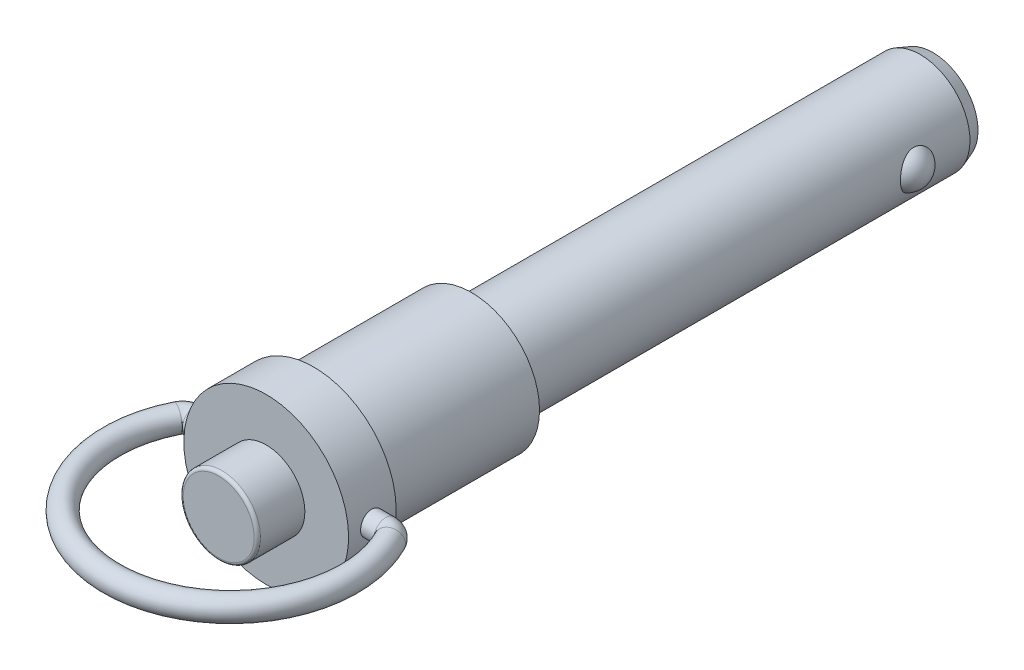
ISO-10303-21;
HEADER;
FILE_DESCRIPTION(('STEP AP214'),'2;1');
FILE_NAME('part.step','',(''),(''),'','','');
FILE_SCHEMA(('AUTOMOTIVE_DESIGN { 1 0 10303 214 1 1 1 1 }'));
ENDSEC;
DATA;
#1=APPLICATION_CONTEXT('core data for automotive mechanical design processes');
#2=APPLICATION_PROTOCOL_DEFINITION('international standard','automotive_design',2000,#1);
#3=PRODUCT_CONTEXT('',#1,'mechanical');
#4=PRODUCT('Part','Part','',(#3));
#5=PRODUCT_RELATED_PRODUCT_CATEGORY('part','',(#4));
#6=PRODUCT_DEFINITION_FORMATION('','',#4);
#7=PRODUCT_DEFINITION_CONTEXT('part definition',#1,'design');
#8=PRODUCT_DEFINITION('design','',#6,#7);
#9=PRODUCT_DEFINITION_SHAPE('','',#8);
#10=(LENGTH_UNIT() NAMED_UNIT(*) SI_UNIT(.MILLI.,.METRE.));
#11=(NAMED_UNIT(*) PLANE_ANGLE_UNIT() SI_UNIT($,.RADIAN.));
#12=(NAMED_UNIT(*) SI_UNIT($,.STERADIAN.) SOLID_ANGLE_UNIT());
#13=UNCERTAINTY_MEASURE_WITH_UNIT(LENGTH_MEASURE(1.E-05),#10,'distance_accuracy_value','');
#14=(GEOMETRIC_REPRESENTATION_CONTEXT(3) GLOBAL_UNCERTAINTY_ASSIGNED_CONTEXT((#13)) GLOBAL_UNIT_ASSIGNED_CONTEXT((#10,
#11,#12)) REPRESENTATION_CONTEXT('',''));
#15=CARTESIAN_POINT('',(0.,0.,0.));
#16=DIRECTION('',(0.,0.,1.));
#17=DIRECTION('',(1.,0.,0.));
#18=AXIS2_PLACEMENT_3D('',#15,#16,#17);
#19=CARTESIAN_POINT('',(-7.23283748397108,0.,-73.9826));
#20=DIRECTION('',(0.,0.,1.));
#21=DIRECTION('',(0.,1.,0.));
#22=AXIS2_PLACEMENT_3D('',#19,#20,#21);
#23=PLANE('',#22);
#24=CARTESIAN_POINT('',(0.,0.,-73.9826));
#25=DIRECTION('',(0.,0.,1.));
#26=DIRECTION('',(0.,1.,0.));
#27=AXIS2_PLACEMENT_3D('',#24,#25,#26);
#28=CIRCLE('',#27,7.23283748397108);
#29=CARTESIAN_POINT('',(0.,7.23283748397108,-73.9826));
#30=VERTEX_POINT('',#29);
#31=EDGE_CURVE('E210',#30,#30,#28,.T.);
#32=ORIENTED_EDGE('',*,*,#31,.F.);
#33=EDGE_LOOP('',(#32));
#34=FACE_BOUND('',#33,.T.);
#35=ADVANCED_FACE('F14',(#34),#23,.F.);
#36=CARTESIAN_POINT('',(6.3254,0.,-63.5178));
#37=DIRECTION('',(0.,0.,1.));
#38=DIRECTION('',(-1.,0.,0.));
#39=AXIS2_PLACEMENT_3D('',#36,#37,#38);
#40=SPHERICAL_SURFACE('',#39,3.175);
#41=CARTESIAN_POINT('',(7.972425,0.,-60.8034062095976));
#42=CARTESIAN_POINT('',(7.97241726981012,0.174963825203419,-60.8034110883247));
#43=CARTESIAN_POINT('',(7.96661031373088,0.350072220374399,-60.8168531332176));
#44=CARTESIAN_POINT('',(7.94391651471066,0.695574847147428,-60.8705412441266));
#45=CARTESIAN_POINT('',(7.92701418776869,0.865962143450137,-60.9108247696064));
#46=CARTESIAN_POINT('',(7.88381094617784,1.19705751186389,-61.0178494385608));
#47=CARTESIAN_POINT('',(7.85750751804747,1.35776298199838,-61.084597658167));
#48=CARTESIAN_POINT('',(7.79828591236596,1.66454963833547,-61.2437588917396));
#49=CARTESIAN_POINT('',(7.76536929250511,1.81063425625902,-61.336165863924));
#50=CARTESIAN_POINT('',(7.6973220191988,2.08082133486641,-61.5434318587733));
#51=CARTESIAN_POINT('',(7.6622476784,2.20529978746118,-61.6578132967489));
#52=CARTESIAN_POINT('',(7.61082801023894,2.374525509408,-61.8452714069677));
#53=CARTESIAN_POINT('',(7.59387880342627,2.42804053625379,-61.9104406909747));
#54=CARTESIAN_POINT('',(7.56094914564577,2.52871559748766,-62.045725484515));
#55=CARTESIAN_POINT('',(7.54496815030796,2.57587922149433,-62.115838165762));
#56=CARTESIAN_POINT('',(7.51569590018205,2.66002101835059,-62.2550958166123));
#57=CARTESIAN_POINT('',(7.50229271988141,2.69749875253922,-62.3239160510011));
#58=CARTESIAN_POINT('',(7.47725403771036,2.76614659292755,-62.4649044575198));
#59=CARTESIAN_POINT('',(7.46561758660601,2.79732008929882,-62.5370708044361));
#60=CARTESIAN_POINT('',(7.44451748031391,2.85299970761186,-62.6841997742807));
#61=CARTESIAN_POINT('',(7.43505273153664,2.87750918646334,-62.7591609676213));
#62=CARTESIAN_POINT('',(7.41863811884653,2.919568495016,-62.9112788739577));
#63=CARTESIAN_POINT('',(7.41168797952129,2.93711908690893,-62.9884353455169));
#64=CARTESIAN_POINT('',(7.40116212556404,2.96353478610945,-63.1359046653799));
#65=CARTESIAN_POINT('',(7.39730521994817,2.97312751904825,-63.2060679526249));
#66=CARTESIAN_POINT('',(7.39192783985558,2.98647205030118,-63.3470623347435));
#67=CARTESIAN_POINT('',(7.3904081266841,2.99022194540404,-63.4178936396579));
#68=CARTESIAN_POINT('',(7.38975833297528,2.99182794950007,-63.5595897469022));
#69=CARTESIAN_POINT('',(7.39062662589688,2.98968807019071,-63.6304544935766));
#70=CARTESIAN_POINT('',(7.39471686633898,2.97955470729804,-63.7717034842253));
#71=CARTESIAN_POINT('',(7.39793967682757,2.97155907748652,-63.8420875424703));
#72=CARTESIAN_POINT('',(7.41052697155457,2.94009947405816,-64.0439191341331));
#73=CARTESIAN_POINT('',(7.42280379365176,2.90920494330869,-64.1741115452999));
#74=CARTESIAN_POINT('',(7.45413145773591,2.82795803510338,-64.4273054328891));
#75=CARTESIAN_POINT('',(7.47318306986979,2.77760344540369,-64.5503060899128));
#76=CARTESIAN_POINT('',(7.51696016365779,2.65690222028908,-64.7909708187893));
#77=CARTESIAN_POINT('',(7.5418730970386,2.58587106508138,-64.9082567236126));
#78=CARTESIAN_POINT('',(7.59450635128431,2.426938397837,-65.1300314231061));
#79=CARTESIAN_POINT('',(7.62222751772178,2.33903179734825,-65.234516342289));
#80=CARTESIAN_POINT('',(7.68069620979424,2.13967899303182,-65.4383986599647));
#81=CARTESIAN_POINT('',(7.71148158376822,2.02679150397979,-65.5363756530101));
#82=CARTESIAN_POINT('',(7.77061509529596,1.78672707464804,-65.7138815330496));
#83=CARTESIAN_POINT('',(7.79896157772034,1.65954056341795,-65.7933979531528));
#84=CARTESIAN_POINT('',(7.85313577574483,1.38188004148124,-65.9395063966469));
#85=CARTESIAN_POINT('',(7.87849512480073,1.23034006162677,-66.0042480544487));
#86=CARTESIAN_POINT('',(7.92093083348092,0.918236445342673,-66.1099613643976));
#87=CARTESIAN_POINT('',(7.9380155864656,0.757682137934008,-66.1509571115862));
#88=CARTESIAN_POINT('',(7.95754077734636,0.496793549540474,-66.1973352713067));
#89=CARTESIAN_POINT('',(7.96310427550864,0.397984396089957,-66.2104005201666));
#90=CARTESIAN_POINT('',(7.97054862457,0.199465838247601,-66.2278312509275));
#91=CARTESIAN_POINT('',(7.97242940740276,0.0997564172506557,-66.2321965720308));
#92=CARTESIAN_POINT('',(7.97241726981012,-0.174963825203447,-66.2321889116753));
#93=CARTESIAN_POINT('',(7.96661031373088,-0.350072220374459,-66.2187468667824));
#94=CARTESIAN_POINT('',(7.94391651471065,-0.695574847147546,-66.1650587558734));
#95=CARTESIAN_POINT('',(7.92701418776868,-0.86596214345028,-66.1247752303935));
#96=CARTESIAN_POINT('',(7.88381094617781,-1.19705751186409,-66.0177505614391));
#97=CARTESIAN_POINT('',(7.85750751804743,-1.3577629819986,-65.9510023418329));
#98=CARTESIAN_POINT('',(7.7982859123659,-1.66454963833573,-65.7918411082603));
#99=CARTESIAN_POINT('',(7.76536929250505,-1.8106342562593,-65.6994341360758));
#100=CARTESIAN_POINT('',(7.69732201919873,-2.08082133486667,-65.4921681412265));
#101=CARTESIAN_POINT('',(7.66224767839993,-2.20529978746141,-65.3777867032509));
#102=CARTESIAN_POINT('',(7.61082801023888,-2.37452550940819,-65.190328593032));
#103=CARTESIAN_POINT('',(7.59387880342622,-2.42804053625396,-65.125159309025));
#104=CARTESIAN_POINT('',(7.56094914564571,-2.52871559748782,-64.9898745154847));
#105=CARTESIAN_POINT('',(7.54496815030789,-2.57587922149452,-64.9197618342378));
#106=CARTESIAN_POINT('',(7.51569590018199,-2.66002101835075,-64.7805041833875));
#107=CARTESIAN_POINT('',(7.50229271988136,-2.69749875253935,-64.7116839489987));
#108=CARTESIAN_POINT('',(7.47725403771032,-2.76614659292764,-64.57069554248));
#109=CARTESIAN_POINT('',(7.46561758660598,-2.79732008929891,-64.4985291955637));
#110=CARTESIAN_POINT('',(7.44451748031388,-2.85299970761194,-64.351400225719));
#111=CARTESIAN_POINT('',(7.43505273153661,-2.87750918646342,-64.2764390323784));
#112=CARTESIAN_POINT('',(7.41863811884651,-2.91956849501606,-64.124321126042));
#113=CARTESIAN_POINT('',(7.41168797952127,-2.93711908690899,-64.0471646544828));
#114=CARTESIAN_POINT('',(7.40116212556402,-2.96353478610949,-63.8996953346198));
#115=CARTESIAN_POINT('',(7.39730521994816,-2.97312751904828,-63.8295320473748));
#116=CARTESIAN_POINT('',(7.39192783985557,-2.98647205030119,-63.6885376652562));
#117=CARTESIAN_POINT('',(7.3904081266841,-2.99022194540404,-63.6177063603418));
#118=CARTESIAN_POINT('',(7.38975833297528,-2.99182794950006,-63.4760102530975));
#119=CARTESIAN_POINT('',(7.39062662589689,-2.98968807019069,-63.4051455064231));
#120=CARTESIAN_POINT('',(7.39471686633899,-2.979554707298,-63.2638965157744));
#121=CARTESIAN_POINT('',(7.39793967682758,-2.97155907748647,-63.1935124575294));
#122=CARTESIAN_POINT('',(7.41052697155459,-2.94009947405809,-62.9916808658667));
#123=CARTESIAN_POINT('',(7.42280379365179,-2.90920494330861,-62.8614884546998));
#124=CARTESIAN_POINT('',(7.45413145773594,-2.82795803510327,-62.6082945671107));
#125=CARTESIAN_POINT('',(7.47318306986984,-2.77760344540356,-62.4852939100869));
#126=CARTESIAN_POINT('',(7.51696016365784,-2.65690222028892,-62.2446291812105));
#127=CARTESIAN_POINT('',(7.54187309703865,-2.58587106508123,-62.1273432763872));
#128=CARTESIAN_POINT('',(7.59450635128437,-2.42693839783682,-61.9055685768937));
#129=CARTESIAN_POINT('',(7.62222751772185,-2.33903179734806,-61.8010836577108));
#130=CARTESIAN_POINT('',(7.68069620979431,-2.13967899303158,-61.5972013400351));
#131=CARTESIAN_POINT('',(7.71148158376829,-2.02679150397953,-61.4992243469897));
#132=CARTESIAN_POINT('',(7.77061509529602,-1.78672707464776,-61.3217184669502));
#133=CARTESIAN_POINT('',(7.7989615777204,-1.65954056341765,-61.242202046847));
#134=CARTESIAN_POINT('',(7.85313577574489,-1.38188004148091,-61.0960936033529));
#135=CARTESIAN_POINT('',(7.87849512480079,-1.23034006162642,-61.0313519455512));
#136=CARTESIAN_POINT('',(7.92093083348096,-0.918236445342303,-60.9256386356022));
#137=CARTESIAN_POINT('',(7.93801558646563,-0.757682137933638,-60.8846428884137));
#138=CARTESIAN_POINT('',(7.95754077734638,-0.496793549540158,-60.8382647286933));
#139=CARTESIAN_POINT('',(7.96310427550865,-0.397984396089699,-60.8251994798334));
#140=CARTESIAN_POINT('',(7.97054862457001,-0.199465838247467,-60.8077687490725));
#141=CARTESIAN_POINT('',(7.97242940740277,-0.0997564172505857,-60.8034034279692));
#142=CARTESIAN_POINT('',(7.972425,0.,-60.8034062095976));
#143=B_SPLINE_CURVE_WITH_KNOTS('',3,(#41,#42,#43,#44,#45,#46,#47,#48,#49,#50,#51,#52,#53,#54,
#55,#56,#57,#58,#59,#60,#61,#62,#63,#64,#65,#66,#67,#68,#69,#70,#71,#72,#73,#74,#75,#76,#77,#78,
#79,#80,#81,#82,#83,#84,#85,#86,#87,#88,#89,#90,#91,#92,#93,#94,#95,#96,#97,#98,#99,#100,#101,
#102,#103,#104,#105,#106,#107,#108,#109,#110,#111,#112,#113,#114,#115,#116,#117,#118,#119,#120,
#121,#122,#123,#124,#125,#126,#127,#128,#129,#130,#131,#132,#133,#134,#135,#136,#137,#138,#139,
#140,#141,#142),.UNSPECIFIED.,.T.,.F.,(4,2,2,2,2,2,2,2,2,2,2,2,2,2,2,2,2,2,2,2,2,2,2,2,2,2,2,2,
2,2,2,2,2,2,2,2,2,2,2,2,2,2,2,2,2,2,2,2,2,2,4),(0.,0.524532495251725,1.04979855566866,
1.57520515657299,2.10048814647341,2.61543479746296,2.87315909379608,3.13073711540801,
3.36891793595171,3.60697032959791,3.8449025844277,4.08280877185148,4.29529683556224,
4.50785409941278,4.72026662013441,4.93275703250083,5.33386765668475,5.73502389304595,
6.15136290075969,6.56782764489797,7.02375816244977,7.47999569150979,7.97801301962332,
8.47552411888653,8.77458316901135,9.07364774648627,9.5981802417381,10.1234463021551,
10.6488529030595,11.17413589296,11.6890825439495,11.9468068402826,12.2043848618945,
12.4425656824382,12.6806180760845,12.9185503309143,13.1564565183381,13.3689445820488,
13.5815018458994,13.793914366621,14.0064047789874,14.4075154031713,14.8086716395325,
15.2250106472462,15.6414753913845,16.0974059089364,16.5536434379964,17.05166076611,
17.5491718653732,17.8482309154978,18.1472954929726),.UNSPECIFIED.);
#144=CARTESIAN_POINT('',(7.972425,0.,-60.8034062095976));
#145=VERTEX_POINT('',#144);
#146=EDGE_CURVE('E170',#145,#145,#143,.T.);
#147=ORIENTED_EDGE('',*,*,#146,.F.);
#148=EDGE_LOOP('',(#147));
#149=FACE_BOUND('',#148,.T.);
#150=ADVANCED_FACE('F143',(#149),#40,.T.);
#151=CARTESIAN_POINT('',(-6.3246,0.,-63.5178));
#152=DIRECTION('',(0.,0.,1.));
#153=DIRECTION('',(-1.,0.,0.));
#154=AXIS2_PLACEMENT_3D('',#151,#152,#153);
#155=SPHERICAL_SURFACE('',#154,3.175);
#156=CARTESIAN_POINT('',(-7.972425,0.,-66.2317082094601));
#157=CARTESIAN_POINT('',(-7.97241727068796,0.174952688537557,-66.2317033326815));
#158=CARTESIAN_POINT('',(-7.96661105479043,0.350049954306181,-66.2182623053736));
#159=CARTESIAN_POINT('',(-7.94392013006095,0.695530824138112,-66.1645780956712));
#160=CARTESIAN_POINT('',(-7.92701993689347,0.865907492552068,-66.1242974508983));
#161=CARTESIAN_POINT('',(-7.88382210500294,1.19698257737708,-66.0172798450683));
#162=CARTESIAN_POINT('',(-7.85752194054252,1.35767837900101,-65.950535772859));
#163=CARTESIAN_POINT('',(-7.79830777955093,1.66444625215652,-65.7913834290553));
#164=CARTESIAN_POINT('',(-7.76539534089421,1.81052175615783,-65.6989812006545));
#165=CARTESIAN_POINT('',(-7.69735815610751,2.08068673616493,-65.4917274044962));
#166=CARTESIAN_POINT('',(-7.66228978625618,2.20515274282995,-65.3773541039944));
#167=CARTESIAN_POINT('',(-7.61087967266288,2.37435974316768,-65.1899087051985));
#168=CARTESIAN_POINT('',(-7.593933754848,2.42786851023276,-65.124743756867));
#169=CARTESIAN_POINT('',(-7.56101087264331,2.52853087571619,-64.9894677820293));
#170=CARTESIAN_POINT('',(-7.54503336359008,2.57568806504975,-64.9193595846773));
#171=CARTESIAN_POINT('',(-7.515769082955,2.65981407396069,-64.7801158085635));
#172=CARTESIAN_POINT('',(-7.5023702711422,2.69728292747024,-64.7113052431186));
#173=CARTESIAN_POINT('',(-7.47734019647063,2.7659135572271,-64.5703368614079));
#174=CARTESIAN_POINT('',(-7.46570798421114,2.79707872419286,-64.4981808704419));
#175=CARTESIAN_POINT('',(-7.44461613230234,2.8527421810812,-64.3510733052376));
#176=CARTESIAN_POINT('',(-7.43515539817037,2.87724383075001,-64.2761231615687));
#177=CARTESIAN_POINT('',(-7.41874848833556,2.91928796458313,-64.1240280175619));
#178=CARTESIAN_POINT('',(-7.41180203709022,2.93683121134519,-64.0468832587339));
#179=CARTESIAN_POINT('',(-7.40128307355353,2.96323267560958,-63.8994411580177));
#180=CARTESIAN_POINT('',(-7.39742927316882,2.97281883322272,-63.829293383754));
#181=CARTESIAN_POINT('',(-7.3920573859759,2.98615137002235,-63.6883306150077));
#182=CARTESIAN_POINT('',(-7.39054006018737,2.98989584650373,-63.6175154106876));
#183=CARTESIAN_POINT('',(-7.38989424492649,2.99149222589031,-63.4758519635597));
#184=CARTESIAN_POINT('',(-7.39076412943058,2.98934813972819,-63.4050037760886));
#185=CARTESIAN_POINT('',(-7.39485671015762,2.97920762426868,-63.2637882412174));
#186=CARTESIAN_POINT('',(-7.39808026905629,2.971209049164,-63.1934210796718));
#187=CARTESIAN_POINT('',(-7.41066840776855,2.93974298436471,-62.9916394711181));
#188=CARTESIAN_POINT('',(-7.42294415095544,2.90884676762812,-62.8614803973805));
#189=CARTESIAN_POINT('',(-7.45426659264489,2.82760178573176,-62.6083526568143));
#190=CARTESIAN_POINT('',(-7.4733140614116,2.77725080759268,-62.4853848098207));
#191=CARTESIAN_POINT('',(-7.51708080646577,2.6565607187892,-62.2447817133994));
#192=CARTESIAN_POINT('',(-7.5419875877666,2.5855367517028,-62.1275248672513));
#193=CARTESIAN_POINT('',(-7.59460690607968,2.42662332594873,-61.9058059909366));
#194=CARTESIAN_POINT('',(-7.62232028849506,2.33872877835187,-61.80134783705));
#195=CARTESIAN_POINT('',(-7.68077324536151,2.13940178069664,-61.5975136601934));
#196=CARTESIAN_POINT('',(-7.71155061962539,2.02652778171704,-61.4995584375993));
#197=CARTESIAN_POINT('',(-7.77066832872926,1.78649437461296,-61.3220926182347));
#198=CARTESIAN_POINT('',(-7.79900700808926,1.65932539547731,-61.2425944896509));
#199=CARTESIAN_POINT('',(-7.85316757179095,1.38169777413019,-61.0965158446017));
#200=CARTESIAN_POINT('',(-7.87852090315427,1.23017281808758,-61.0317864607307));
#201=CARTESIAN_POINT('',(-7.92094613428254,0.918101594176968,-60.9260941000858));
#202=CARTESIAN_POINT('',(-7.93802642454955,0.757564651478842,-60.8851070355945));
#203=CARTESIAN_POINT('',(-7.95754577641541,0.496710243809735,-60.8387404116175));
#204=CARTESIAN_POINT('',(-7.96310740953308,0.397917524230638,-60.8256788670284));
#205=CARTESIAN_POINT('',(-7.97054925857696,0.199432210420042,-60.8082530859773));
#206=CARTESIAN_POINT('',(-7.97242940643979,0.0997395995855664,-60.8038890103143));
#207=CARTESIAN_POINT('',(-7.97241727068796,-0.174952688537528,-60.8038966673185));
#208=CARTESIAN_POINT('',(-7.96661105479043,-0.350049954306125,-60.8173376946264));
#209=CARTESIAN_POINT('',(-7.94392013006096,-0.695530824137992,-60.8710219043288));
#210=CARTESIAN_POINT('',(-7.92701993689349,-0.86590749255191,-60.9113025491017));
#211=CARTESIAN_POINT('',(-7.88382210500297,-1.19698257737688,-61.0183201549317));
#212=CARTESIAN_POINT('',(-7.85752194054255,-1.3576783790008,-61.0850642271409));
#213=CARTESIAN_POINT('',(-7.79830777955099,-1.66444625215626,-61.2442165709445));
#214=CARTESIAN_POINT('',(-7.76539534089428,-1.81052175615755,-61.3366187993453));
#215=CARTESIAN_POINT('',(-7.69735815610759,-2.08068673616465,-61.5438725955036));
#216=CARTESIAN_POINT('',(-7.66228978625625,-2.2051527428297,-61.6582458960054));
#217=CARTESIAN_POINT('',(-7.61087967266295,-2.37435974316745,-61.8456912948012));
#218=CARTESIAN_POINT('',(-7.59393375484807,-2.42786851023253,-61.9108562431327));
#219=CARTESIAN_POINT('',(-7.56101087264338,-2.52853087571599,-62.0461322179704));
#220=CARTESIAN_POINT('',(-7.54503336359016,-2.57568806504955,-62.1162404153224));
#221=CARTESIAN_POINT('',(-7.51576908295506,-2.65981407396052,-62.2554841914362));
#222=CARTESIAN_POINT('',(-7.50237027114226,-2.69728292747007,-62.3242947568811));
#223=CARTESIAN_POINT('',(-7.47734019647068,-2.76591355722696,-62.4652631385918));
#224=CARTESIAN_POINT('',(-7.46570798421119,-2.79707872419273,-62.5374191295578));
#225=CARTESIAN_POINT('',(-7.44461613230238,-2.8527421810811,-62.6845266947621));
#226=CARTESIAN_POINT('',(-7.4351553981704,-2.87724383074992,-62.759476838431));
#227=CARTESIAN_POINT('',(-7.41874848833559,-2.91928796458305,-62.9115719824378));
#228=CARTESIAN_POINT('',(-7.41180203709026,-2.93683121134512,-62.9887167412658));
#229=CARTESIAN_POINT('',(-7.40128307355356,-2.96323267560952,-63.136158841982));
#230=CARTESIAN_POINT('',(-7.39742927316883,-2.97281883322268,-63.2063066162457));
#231=CARTESIAN_POINT('',(-7.3920573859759,-2.98615137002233,-63.3472693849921));
#232=CARTESIAN_POINT('',(-7.39054006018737,-2.98989584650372,-63.4180845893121));
#233=CARTESIAN_POINT('',(-7.38989424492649,-2.99149222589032,-63.55974803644));
#234=CARTESIAN_POINT('',(-7.39076412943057,-2.9893481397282,-63.6305962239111));
#235=CARTESIAN_POINT('',(-7.3948567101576,-2.97920762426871,-63.7718117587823));
#236=CARTESIAN_POINT('',(-7.39808026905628,-2.97120904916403,-63.8421789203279));
#237=CARTESIAN_POINT('',(-7.41066840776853,-2.93974298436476,-64.0439605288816));
#238=CARTESIAN_POINT('',(-7.42294415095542,-2.90884676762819,-64.1741196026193));
#239=CARTESIAN_POINT('',(-7.45426659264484,-2.82760178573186,-64.4272473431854));
#240=CARTESIAN_POINT('',(-7.47331406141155,-2.77725080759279,-64.550215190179));
#241=CARTESIAN_POINT('',(-7.51708080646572,-2.65656071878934,-64.7908182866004));
#242=CARTESIAN_POINT('',(-7.54198758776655,-2.58553675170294,-64.9080751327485));
#243=CARTESIAN_POINT('',(-7.59460690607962,-2.4266233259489,-65.1297940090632));
#244=CARTESIAN_POINT('',(-7.62232028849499,-2.33872877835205,-65.2342521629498));
#245=CARTESIAN_POINT('',(-7.68077324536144,-2.13940178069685,-65.4380863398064));
#246=CARTESIAN_POINT('',(-7.71155061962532,-2.02652778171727,-65.5360415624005));
#247=CARTESIAN_POINT('',(-7.7706683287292,-1.78649437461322,-65.7135073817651));
#248=CARTESIAN_POINT('',(-7.7990070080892,-1.65932539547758,-65.7930055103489));
#249=CARTESIAN_POINT('',(-7.8531675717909,-1.38169777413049,-65.9390841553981));
#250=CARTESIAN_POINT('',(-7.87852090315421,-1.23017281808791,-66.0038135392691));
#251=CARTESIAN_POINT('',(-7.9209461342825,-0.918101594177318,-66.1095058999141));
#252=CARTESIAN_POINT('',(-7.93802642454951,-0.75756465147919,-66.1504929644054));
#253=CARTESIAN_POINT('',(-7.95754577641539,-0.496710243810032,-66.1968595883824));
#254=CARTESIAN_POINT('',(-7.96310740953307,-0.397917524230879,-66.2099211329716));
#255=CARTESIAN_POINT('',(-7.97054925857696,-0.199432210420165,-66.2273469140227));
#256=CARTESIAN_POINT('',(-7.97242940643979,-0.0997395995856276,-66.2317109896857));
#257=CARTESIAN_POINT('',(-7.972425,0.,-66.2317082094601));
#258=B_SPLINE_CURVE_WITH_KNOTS('',3,(#156,#157,#158,#159,#160,#161,#162,#163,#164,#165,#166,
#167,#168,#169,#170,#171,#172,#173,#174,#175,#176,#177,#178,#179,#180,#181,#182,#183,#184,#185,
#186,#187,#188,#189,#190,#191,#192,#193,#194,#195,#196,#197,#198,#199,#200,#201,#202,#203,#204,
#205,#206,#207,#208,#209,#210,#211,#212,#213,#214,#215,#216,#217,#218,#219,#220,#221,#222,#223,
#224,#225,#226,#227,#228,#229,#230,#231,#232,#233,#234,#235,#236,#237,#238,#239,#240,#241,#242,
#243,#244,#245,#246,#247,#248,#249,#250,#251,#252,#253,#254,#255,#256,#257),.UNSPECIFIED.,.T.,
.F.,(4,2,2,2,2,2,2,2,2,2,2,2,2,2,2,2,2,2,2,2,2,2,2,2,2,2,2,2,2,2,2,2,2,2,2,2,2,2,2,2,2,2,2,2,2,
2,2,2,2,2,4),(0.,0.524499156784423,1.04973194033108,1.57510595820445,2.10035634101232,
2.61525617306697,2.87295695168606,3.130511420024,3.36865238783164,3.6066649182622,
3.84455721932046,4.08242344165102,4.29486234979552,4.50737043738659,4.71973381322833,
4.93217506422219,5.33319020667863,5.7342509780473,6.15050279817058,6.56688037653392,
7.02273464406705,7.47889596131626,7.97685568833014,8.47430932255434,8.77331798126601,
9.07233216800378,9.59683132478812,10.1220641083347,10.647438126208,11.1726885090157,
11.6875883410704,11.9452891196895,12.2028435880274,12.4409845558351,12.6789970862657,
12.9168893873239,13.1547556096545,13.367194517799,13.5797026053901,13.7920659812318,
14.0045072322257,14.4055223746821,14.8065831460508,15.2228349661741,15.6392125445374,
16.0950668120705,16.5512281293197,17.0491878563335,17.5466414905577,17.8456501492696,
18.1446643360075),.UNSPECIFIED.);
#259=CARTESIAN_POINT('',(-7.972425,0.,-66.2317082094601));
#260=VERTEX_POINT('',#259);
#261=EDGE_CURVE('E25',#260,#260,#258,.T.);
#262=ORIENTED_EDGE('',*,*,#261,.F.);
#263=EDGE_LOOP('',(#262));
#264=FACE_BOUND('',#263,.T.);
#265=ADVANCED_FACE('F149',(#264),#155,.T.);
#266=CARTESIAN_POINT('',(0.,0.,-71.9506));
#267=DIRECTION('',(0.,0.,1.));
#268=DIRECTION('',(0.,1.,0.));
#269=AXIS2_PLACEMENT_3D('',#266,#267,#268);
#270=CONICAL_SURFACE('',#269,7.972425,0.349065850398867);
#271=CARTESIAN_POINT('',(0.,0.,-71.9506));
#272=DIRECTION('',(0.,0.,1.));
#273=DIRECTION('',(0.,1.,0.));
#274=AXIS2_PLACEMENT_3D('',#271,#272,#273);
#275=CIRCLE('',#274,7.972425);
#276=CARTESIAN_POINT('',(0.,7.972425,-71.9506));
#277=VERTEX_POINT('',#276);
#278=EDGE_CURVE('E9',#277,#277,#275,.T.);
#279=ORIENTED_EDGE('',*,*,#278,.F.);
#280=EDGE_LOOP('',(#279));
#281=FACE_BOUND('',#280,.T.);
#282=ORIENTED_EDGE('',*,*,#31,.T.);
#283=EDGE_LOOP('',(#282));
#284=FACE_BOUND('',#283,.T.);
#285=ADVANCED_FACE('F177',(#281,#284),#270,.T.);
#286=CARTESIAN_POINT('',(0.,0.,-10.));
#287=DIRECTION('',(0.,0.,1.));
#288=DIRECTION('',(0.810321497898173,0.585985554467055,0.));
#289=AXIS2_PLACEMENT_3D('',#286,#287,#288);
#290=CYLINDRICAL_SURFACE('',#289,7.972425);
#291=CARTESIAN_POINT('',(0.,0.,0.));
#292=DIRECTION('',(0.,0.,-1.));
#293=DIRECTION('',(0.,1.,0.));
#294=AXIS2_PLACEMENT_3D('',#291,#292,#293);
#295=CIRCLE('',#294,7.972425);
#296=CARTESIAN_POINT('',(0.,7.97242500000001,0.));
#297=VERTEX_POINT('',#296);
#298=EDGE_CURVE('E162',#297,#297,#295,.T.);
#299=ORIENTED_EDGE('',*,*,#298,.T.);
#300=EDGE_LOOP('',(#299));
#301=FACE_BOUND('',#300,.T.);
#302=ORIENTED_EDGE('',*,*,#278,.T.);
#303=EDGE_LOOP('',(#302));
#304=FACE_BOUND('',#303,.T.);
#305=ORIENTED_EDGE('',*,*,#261,.T.);
#306=EDGE_LOOP('',(#305));
#307=FACE_BOUND('',#306,.T.);
#308=ORIENTED_EDGE('',*,*,#146,.T.);
#309=EDGE_LOOP('',(#308));
#310=FACE_BOUND('',#309,.T.);
#311=ADVANCED_FACE('F63',(#301,#304,#307,#310),#290,.T.);
#312=CARTESIAN_POINT('',(0.,0.,40.545));
#313=DIRECTION('',(0.,0.,1.));
#314=DIRECTION('',(0.,1.,0.));
#315=AXIS2_PLACEMENT_3D('',#312,#313,#314);
#316=PLANE('',#315);
#317=CARTESIAN_POINT('',(0.,0.,40.545));
#318=DIRECTION('',(0.,0.,-1.));
#319=DIRECTION('',(0.,-1.,0.));
#320=AXIS2_PLACEMENT_3D('',#317,#318,#319);
#321=CIRCLE('',#320,5.6896);
#322=CARTESIAN_POINT('',(0.,-5.6896,40.545));
#323=VERTEX_POINT('',#322);
#324=CARTESIAN_POINT('',(0.,5.6896,40.545));
#325=VERTEX_POINT('',#324);
#326=EDGE_CURVE('E38',#323,#325,#321,.T.);
#327=ORIENTED_EDGE('',*,*,#326,.F.);
#328=CARTESIAN_POINT('',(0.,0.,40.545));
#329=DIRECTION('',(0.,0.,-1.));
#330=DIRECTION('',(0.,1.,0.));
#331=AXIS2_PLACEMENT_3D('',#328,#329,#330);
#332=CIRCLE('',#331,5.6896);
#333=EDGE_CURVE('E32',#325,#323,#332,.T.);
#334=ORIENTED_EDGE('',*,*,#333,.F.);
#335=EDGE_LOOP('',(#327,#334));
#336=FACE_BOUND('',#335,.T.);
#337=ADVANCED_FACE('F43',(#336),#316,.T.);
#338=CARTESIAN_POINT('',(0.,0.,38.64));
#339=DIRECTION('',(0.,1.,0.));
#340=DIRECTION('',(-1.,0.,0.));
#341=AXIS2_PLACEMENT_3D('',#338,#339,#340);
#342=TOROIDAL_SURFACE('',#341,19.05,1.8796);
#343=CARTESIAN_POINT('',(-17.0651122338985,0.,30.1733333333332));
#344=DIRECTION('',(-0.44444444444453,0.,0.895806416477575));
#345=DIRECTION('',(-0.895806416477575,0.,-0.44444444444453));
#346=AXIS2_PLACEMENT_3D('',#343,#344,#345);
#347=CIRCLE('',#346,1.8796);
#348=CARTESIAN_POINT('',(-18.7488699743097,0.,29.3379555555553));
#349=VERTEX_POINT('',#348);
#350=EDGE_CURVE('E108',#349,#349,#347,.F.);
#351=ORIENTED_EDGE('',*,*,#350,.F.);
#352=EDGE_LOOP('',(#351));
#353=FACE_BOUND('',#352,.T.);
#354=CARTESIAN_POINT('',(17.0651122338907,0.,30.1733333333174));
#355=DIRECTION('',(-0.444444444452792,0.,-0.895806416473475));
#356=DIRECTION('',(0.895806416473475,0.,-0.444444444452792));
#357=AXIS2_PLACEMENT_3D('',#354,#355,#356);
#358=CIRCLE('',#357,1.8796);
#359=CARTESIAN_POINT('',(18.7488699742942,0.,29.3379555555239));
#360=VERTEX_POINT('',#359);
#361=EDGE_CURVE('E105',#360,#360,#358,.T.);
#362=ORIENTED_EDGE('',*,*,#361,.F.);
#363=EDGE_LOOP('',(#362));
#364=FACE_BOUND('',#363,.T.);
#365=ADVANCED_FACE('F62',(#353,#364),#342,.T.);
#366=CARTESIAN_POINT('',(0.,0.,40.037));
#367=DIRECTION('',(0.,0.,1.));
#368=DIRECTION('',(0.,1.,0.));
#369=AXIS2_PLACEMENT_3D('',#366,#367,#368);
#370=TOROIDAL_SURFACE('',#369,5.6896,0.508);
#371=ORIENTED_EDGE('',*,*,#333,.T.);
#372=ORIENTED_EDGE('',*,*,#326,.T.);
#373=EDGE_LOOP('',(#371,#372));
#374=FACE_BOUND('',#373,.T.);
#375=CARTESIAN_POINT('',(0.,0.,40.037));
#376=DIRECTION('',(0.,0.,-1.));
#377=DIRECTION('',(0.,-1.,0.));
#378=AXIS2_PLACEMENT_3D('',#375,#376,#377);
#379=CIRCLE('',#378,6.1976);
#380=CARTESIAN_POINT('',(0.,-6.1976,40.037));
#381=VERTEX_POINT('',#380);
#382=EDGE_CURVE('E82',#381,#381,#379,.T.);
#383=ORIENTED_EDGE('',*,*,#382,.F.);
#384=EDGE_LOOP('',(#383));
#385=FACE_BOUND('',#384,.T.);
#386=ADVANCED_FACE('F36',(#374,#385),#370,.T.);
#387=CARTESIAN_POINT('',(-15.3586010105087,0.,31.02));
#388=DIRECTION('',(0.,1.,0.));
#389=DIRECTION('',(-1.,0.,0.));
#390=AXIS2_PLACEMENT_3D('',#387,#388,#389);
#391=TOROIDAL_SURFACE('',#390,1.905,1.8796);
#392=CARTESIAN_POINT('',(-15.3586010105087,0.,29.115));
#393=DIRECTION('',(1.,0.,0.));
#394=DIRECTION('',(0.,0.,-1.));
#395=AXIS2_PLACEMENT_3D('',#392,#393,#394);
#396=CIRCLE('',#395,1.8796);
#397=CARTESIAN_POINT('',(-15.3586010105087,0.,27.2354));
#398=VERTEX_POINT('',#397);
#399=EDGE_CURVE('E40',#398,#398,#396,.T.);
#400=ORIENTED_EDGE('',*,*,#399,.F.);
#401=EDGE_LOOP('',(#400));
#402=FACE_BOUND('',#401,.T.);
#403=ORIENTED_EDGE('',*,*,#350,.T.);
#404=EDGE_LOOP('',(#403));
#405=FACE_BOUND('',#404,.T.);
#406=ADVANCED_FACE('F65',(#402,#405),#391,.T.);
#407=CARTESIAN_POINT('',(15.3586010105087,0.,31.02));
#408=DIRECTION('',(0.,1.,0.));
#409=DIRECTION('',(-1.,0.,0.));
#410=AXIS2_PLACEMENT_3D('',#407,#408,#409);
#411=TOROIDAL_SURFACE('',#410,1.90500000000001,1.8796);
#412=CARTESIAN_POINT('',(15.3586010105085,0.,29.115));
#413=DIRECTION('',(1.,0.,0.));
#414=DIRECTION('',(0.,0.,-1.));
#415=AXIS2_PLACEMENT_3D('',#412,#413,#414);
#416=CIRCLE('',#415,1.8796);
#417=CARTESIAN_POINT('',(15.3586010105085,0.,27.2354));
#418=VERTEX_POINT('',#417);
#419=EDGE_CURVE('E44',#418,#418,#416,.F.);
#420=ORIENTED_EDGE('',*,*,#419,.F.);
#421=EDGE_LOOP('',(#420));
#422=FACE_BOUND('',#421,.T.);
#423=ORIENTED_EDGE('',*,*,#361,.T.);
#424=EDGE_LOOP('',(#423));
#425=FACE_BOUND('',#424,.T.);
#426=ADVANCED_FACE('F67',(#422,#425),#411,.T.);
#427=CARTESIAN_POINT('',(0.,0.,40.545));
#428=DIRECTION('',(0.,0.,-1.));
#429=DIRECTION('',(0.,-1.,0.));
#430=AXIS2_PLACEMENT_3D('',#427,#428,#429);
#431=CYLINDRICAL_SURFACE('',#430,6.1976);
#432=CARTESIAN_POINT('',(0.,0.,32.925));
#433=DIRECTION('',(0.,0.,-1.));
#434=DIRECTION('',(0.,-1.,0.));
#435=AXIS2_PLACEMENT_3D('',#432,#433,#434);
#436=CIRCLE('',#435,6.1976);
#437=CARTESIAN_POINT('',(0.,-6.1976,32.925));
#438=VERTEX_POINT('',#437);
#439=EDGE_CURVE('E118',#438,#438,#436,.T.);
#440=ORIENTED_EDGE('',*,*,#439,.F.);
#441=EDGE_LOOP('',(#440));
#442=FACE_BOUND('',#441,.T.);
#443=ORIENTED_EDGE('',*,*,#382,.T.);
#444=EDGE_LOOP('',(#443));
#445=FACE_BOUND('',#444,.T.);
#446=ADVANCED_FACE('F87',(#442,#445),#431,.T.);
#447=CARTESIAN_POINT('',(-15.3586010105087,0.,29.115));
#448=DIRECTION('',(1.,0.,0.));
#449=DIRECTION('',(0.,0.,-1.));
#450=AXIS2_PLACEMENT_3D('',#447,#448,#449);
#451=CYLINDRICAL_SURFACE('',#450,1.8796);
#452=CARTESIAN_POINT('',(-13.208,0.,27.2354));
#453=CARTESIAN_POINT('',(-13.2079983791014,0.105008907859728,27.235404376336));
#454=CARTESIAN_POINT('',(-13.2067345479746,0.210080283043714,27.2442296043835));
#455=CARTESIAN_POINT('',(-13.2018144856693,0.41729041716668,27.2792908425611));
#456=CARTESIAN_POINT('',(-13.1981558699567,0.519426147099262,27.3055442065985));
#457=CARTESIAN_POINT('',(-13.1888577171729,0.7177359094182,27.3746649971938));
#458=CARTESIAN_POINT('',(-13.1832196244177,0.813914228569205,27.4175203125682));
#459=CARTESIAN_POINT('',(-13.1705868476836,0.99769843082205,27.5185998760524));
#460=CARTESIAN_POINT('',(-13.1635923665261,1.08530559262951,27.5768218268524));
#461=CARTESIAN_POINT('',(-13.1489704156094,1.25009506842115,27.7074204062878));
#462=CARTESIAN_POINT('',(-13.1413392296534,1.32720810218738,27.7798840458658));
#463=CARTESIAN_POINT('',(-13.1263333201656,1.46822296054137,27.9367218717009));
#464=CARTESIAN_POINT('',(-13.1189586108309,1.5321240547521,28.0210967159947));
#465=CARTESIAN_POINT('',(-13.1052644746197,1.6451672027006,28.1998226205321));
#466=CARTESIAN_POINT('',(-13.0989498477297,1.69424288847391,28.2942160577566));
#467=CARTESIAN_POINT('',(-13.088141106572,1.77581811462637,28.490010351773));
#468=CARTESIAN_POINT('',(-13.0836469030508,1.80831846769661,28.5914108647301));
#469=CARTESIAN_POINT('',(-13.0770241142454,1.85560673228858,28.7976151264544));
#470=CARTESIAN_POINT('',(-13.0748797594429,1.87051276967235,28.9023912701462));
#471=CARTESIAN_POINT('',(-13.0731514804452,1.88255508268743,29.1129780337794));
#472=CARTESIAN_POINT('',(-13.0735674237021,1.87969227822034,29.2187885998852));
#473=CARTESIAN_POINT('',(-13.0768983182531,1.85637484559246,29.4276098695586));
#474=CARTESIAN_POINT('',(-13.07979464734,1.8360513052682,29.5306355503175));
#475=CARTESIAN_POINT('',(-13.0877308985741,1.77859429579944,29.7317993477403));
#476=CARTESIAN_POINT('',(-13.0927708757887,1.74146039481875,29.8299373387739));
#477=CARTESIAN_POINT('',(-13.1044472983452,1.65129893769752,30.0189415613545));
#478=CARTESIAN_POINT('',(-13.1110893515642,1.59821538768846,30.1097807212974));
#479=CARTESIAN_POINT('',(-13.1252173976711,1.47770141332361,30.281311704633));
#480=CARTESIAN_POINT('',(-13.1327034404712,1.4102701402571,30.3620029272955));
#481=CARTESIAN_POINT('',(-13.1477584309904,1.26225301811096,30.5117076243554));
#482=CARTESIAN_POINT('',(-13.1553275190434,1.18155436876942,30.5806096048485));
#483=CARTESIAN_POINT('',(-13.1696331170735,1.00967896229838,30.7039085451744));
#484=CARTESIAN_POINT('',(-13.1763696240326,0.918502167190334,30.7583054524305));
#485=CARTESIAN_POINT('',(-13.1882570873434,0.728165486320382,30.8510539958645));
#486=CARTESIAN_POINT('',(-13.1934072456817,0.62900161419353,30.8893975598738));
#487=CARTESIAN_POINT('',(-13.2015349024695,0.425552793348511,30.9488568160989));
#488=CARTESIAN_POINT('',(-13.2045125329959,0.321268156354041,30.969973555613));
#489=CARTESIAN_POINT('',(-13.2079422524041,0.111500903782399,30.9942327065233));
#490=CARTESIAN_POINT('',(-13.2084158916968,0.00603636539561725,30.9975284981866));
#491=CARTESIAN_POINT('',(-13.2068427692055,-0.203940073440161,30.9864585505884));
#492=CARTESIAN_POINT('',(-13.2047960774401,-0.308452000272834,30.9720933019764));
#493=CARTESIAN_POINT('',(-13.1984256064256,-0.513095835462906,30.9262365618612));
#494=CARTESIAN_POINT('',(-13.1941116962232,-0.613244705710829,30.894819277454));
#495=CARTESIAN_POINT('',(-13.1836891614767,-0.806853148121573,30.8158281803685));
#496=CARTESIAN_POINT('',(-13.1775804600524,-0.900312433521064,30.768253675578));
#497=CARTESIAN_POINT('',(-13.1641942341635,-1.07856665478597,30.6579350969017));
#498=CARTESIAN_POINT('',(-13.1569092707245,-1.16330041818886,30.5950930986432));
#499=CARTESIAN_POINT('',(-13.1420059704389,-1.32107337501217,30.4561604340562));
#500=CARTESIAN_POINT('',(-13.1343876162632,-1.39411195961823,30.3800690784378));
#501=CARTESIAN_POINT('',(-13.1196084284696,-1.52697484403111,30.2161171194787));
#502=CARTESIAN_POINT('',(-13.1124514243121,-1.58669669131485,30.1281730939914));
#503=CARTESIAN_POINT('',(-13.099471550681,-1.69052011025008,29.9434117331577));
#504=CARTESIAN_POINT('',(-13.0936486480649,-1.73462206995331,29.8465946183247));
#505=CARTESIAN_POINT('',(-13.0840235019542,-1.80579270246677,29.6471490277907));
#506=CARTESIAN_POINT('',(-13.0802147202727,-1.83291654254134,29.5445405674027));
#507=CARTESIAN_POINT('',(-13.0750312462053,-1.86953730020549,29.336166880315));
#508=CARTESIAN_POINT('',(-13.0736564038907,-1.87903530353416,29.2304018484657));
#509=CARTESIAN_POINT('',(-13.0735016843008,-1.88011086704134,29.0197377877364));
#510=CARTESIAN_POINT('',(-13.0746984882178,-1.87184946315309,28.9148395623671));
#511=CARTESIAN_POINT('',(-13.0795017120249,-1.83798448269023,28.7079399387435));
#512=CARTESIAN_POINT('',(-13.0831081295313,-1.81238092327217,28.6059385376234));
#513=CARTESIAN_POINT('',(-13.092316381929,-1.74461326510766,28.4077650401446));
#514=CARTESIAN_POINT('',(-13.0979169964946,-1.70245929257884,28.3115894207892));
#515=CARTESIAN_POINT('',(-13.1104842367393,-1.60280330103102,28.1276498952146));
#516=CARTESIAN_POINT('',(-13.1174508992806,-1.54530086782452,28.0398862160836));
#517=CARTESIAN_POINT('',(-13.1320406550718,-1.41599095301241,27.8744419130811));
#518=CARTESIAN_POINT('',(-13.1396689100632,-1.34406391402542,27.7968551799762));
#519=CARTESIAN_POINT('',(-13.1546784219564,-1.18819878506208,27.6547945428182));
#520=CARTESIAN_POINT('',(-13.1620596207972,-1.10425789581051,27.590323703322));
#521=CARTESIAN_POINT('',(-13.1757845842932,-0.926263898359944,27.4760444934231));
#522=CARTESIAN_POINT('',(-13.1821230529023,-0.832162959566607,27.4263100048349));
#523=CARTESIAN_POINT('',(-13.1929960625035,-0.636900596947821,27.3434245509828));
#524=CARTESIAN_POINT('',(-13.1975325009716,-0.535746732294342,27.3102561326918));
#525=CARTESIAN_POINT('',(-13.2032356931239,-0.361762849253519,27.2691055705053));
#526=CARTESIAN_POINT('',(-13.205013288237,-0.29001488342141,27.2564849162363));
#527=CARTESIAN_POINT('',(-13.2073959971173,-0.145521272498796,27.2396306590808));
#528=CARTESIAN_POINT('',(-13.2080011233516,-0.0727756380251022,27.2353969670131));
#529=CARTESIAN_POINT('',(-13.208,0.,27.2354));
#530=B_SPLINE_CURVE_WITH_KNOTS('',3,(#452,#453,#454,#455,#456,#457,#458,#459,#460,#461,#462,
#463,#464,#465,#466,#467,#468,#469,#470,#471,#472,#473,#474,#475,#476,#477,#478,#479,#480,#481,
#482,#483,#484,#485,#486,#487,#488,#489,#490,#491,#492,#493,#494,#495,#496,#497,#498,#499,#500,
#501,#502,#503,#504,#505,#506,#507,#508,#509,#510,#511,#512,#513,#514,#515,#516,#517,#518,#519,
#520,#521,#522,#523,#524,#525,#526,#527,#528,#529),.UNSPECIFIED.,.T.,.F.,(4,2,2,2,2,2,2,2,2,2,2,
2,2,2,2,2,2,2,2,2,2,2,2,2,2,2,2,2,2,2,2,2,2,2,2,2,2,2,4),(0.,0.314760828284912,
0.629835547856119,0.944680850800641,1.25947911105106,1.57626405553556,1.89306650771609,
2.21126684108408,2.52945157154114,2.84548767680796,3.16150742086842,3.4751751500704,
3.78885093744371,4.10364106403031,4.41844981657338,4.736088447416,5.05372822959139,
5.37152754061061,5.68930752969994,6.00434806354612,6.3193798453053,6.63305153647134,
6.94673666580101,7.26248947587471,7.57825871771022,7.89637938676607,8.21449215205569,
8.53156582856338,8.84861997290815,9.16281131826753,9.4770023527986,9.79100145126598,
10.1050090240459,10.42173562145,10.7385361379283,11.0568990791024,11.3749259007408,
11.5930708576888,11.8112134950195),.UNSPECIFIED.);
#531=CARTESIAN_POINT('',(-13.208,0.,27.2354));
#532=VERTEX_POINT('',#531);
#533=EDGE_CURVE('E193',#532,#532,#530,.T.);
#534=ORIENTED_EDGE('',*,*,#533,.F.);
#535=EDGE_LOOP('',(#534));
#536=FACE_BOUND('',#535,.T.);
#537=ORIENTED_EDGE('',*,*,#399,.T.);
#538=EDGE_LOOP('',(#537));
#539=FACE_BOUND('',#538,.T.);
#540=ADVANCED_FACE('F88',(#536,#539),#451,.T.);
#541=CARTESIAN_POINT('',(-15.3586010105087,0.,29.115));
#542=DIRECTION('',(1.,0.,0.));
#543=DIRECTION('',(0.,0.,-1.));
#544=AXIS2_PLACEMENT_3D('',#541,#542,#543);
#545=CYLINDRICAL_SURFACE('',#544,1.8796);
#546=CARTESIAN_POINT('',(13.208,0.,27.2354));
#547=CARTESIAN_POINT('',(13.2079983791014,-0.105008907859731,27.235404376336));
#548=CARTESIAN_POINT('',(13.2067345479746,-0.210080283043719,27.2442296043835));
#549=CARTESIAN_POINT('',(13.2018144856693,-0.417290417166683,27.2792908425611));
#550=CARTESIAN_POINT('',(13.1981558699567,-0.51942614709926,27.3055442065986));
#551=CARTESIAN_POINT('',(13.1888577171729,-0.717735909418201,27.3746649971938));
#552=CARTESIAN_POINT('',(13.1832196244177,-0.813914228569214,27.4175203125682));
#553=CARTESIAN_POINT('',(13.1705868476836,-0.997698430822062,27.5185998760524));
#554=CARTESIAN_POINT('',(13.1635923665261,-1.08530559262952,27.5768218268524));
#555=CARTESIAN_POINT('',(13.1489704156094,-1.25009506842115,27.7074204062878));
#556=CARTESIAN_POINT('',(13.1413392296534,-1.32720810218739,27.7798840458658));
#557=CARTESIAN_POINT('',(13.1263333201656,-1.46822296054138,27.9367218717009));
#558=CARTESIAN_POINT('',(13.1189586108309,-1.5321240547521,28.0210967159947));
#559=CARTESIAN_POINT('',(13.1052644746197,-1.6451672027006,28.1998226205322));
#560=CARTESIAN_POINT('',(13.0989498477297,-1.69424288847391,28.2942160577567));
#561=CARTESIAN_POINT('',(13.088141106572,-1.77581811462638,28.490010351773));
#562=CARTESIAN_POINT('',(13.0836469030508,-1.80831846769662,28.5914108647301));
#563=CARTESIAN_POINT('',(13.0770241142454,-1.85560673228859,28.7976151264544));
#564=CARTESIAN_POINT('',(13.0748797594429,-1.87051276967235,28.9023912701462));
#565=CARTESIAN_POINT('',(13.0731514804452,-1.88255508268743,29.1129780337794));
#566=CARTESIAN_POINT('',(13.0735674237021,-1.87969227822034,29.2187885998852));
#567=CARTESIAN_POINT('',(13.0768983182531,-1.85637484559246,29.4276098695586));
#568=CARTESIAN_POINT('',(13.07979464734,-1.8360513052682,29.5306355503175));
#569=CARTESIAN_POINT('',(13.0877308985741,-1.77859429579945,29.7317993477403));
#570=CARTESIAN_POINT('',(13.0927708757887,-1.74146039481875,29.8299373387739));
#571=CARTESIAN_POINT('',(13.1044472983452,-1.65129893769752,30.0189415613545));
#572=CARTESIAN_POINT('',(13.1110893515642,-1.59821538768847,30.1097807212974));
#573=CARTESIAN_POINT('',(13.1252173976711,-1.47770141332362,30.281311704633));
#574=CARTESIAN_POINT('',(13.1327034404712,-1.4102701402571,30.3620029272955));
#575=CARTESIAN_POINT('',(13.1477584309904,-1.26225301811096,30.5117076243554));
#576=CARTESIAN_POINT('',(13.1553275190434,-1.18155436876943,30.5806096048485));
#577=CARTESIAN_POINT('',(13.1696331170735,-1.00967896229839,30.7039085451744));
#578=CARTESIAN_POINT('',(13.1763696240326,-0.918502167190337,30.7583054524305));
#579=CARTESIAN_POINT('',(13.1882570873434,-0.728165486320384,30.8510539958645));
#580=CARTESIAN_POINT('',(13.1934072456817,-0.629001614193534,30.8893975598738));
#581=CARTESIAN_POINT('',(13.2015349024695,-0.425552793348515,30.9488568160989));
#582=CARTESIAN_POINT('',(13.2045125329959,-0.321268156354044,30.969973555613));
#583=CARTESIAN_POINT('',(13.2079422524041,-0.111500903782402,30.9942327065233));
#584=CARTESIAN_POINT('',(13.2084158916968,-0.0060363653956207,30.9975284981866));
#585=CARTESIAN_POINT('',(13.2068427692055,0.203940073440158,30.9864585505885));
#586=CARTESIAN_POINT('',(13.2047960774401,0.308452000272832,30.9720933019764));
#587=CARTESIAN_POINT('',(13.1984256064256,0.513095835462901,30.9262365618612));
#588=CARTESIAN_POINT('',(13.1941116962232,0.613244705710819,30.894819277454));
#589=CARTESIAN_POINT('',(13.1836891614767,0.806853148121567,30.8158281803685));
#590=CARTESIAN_POINT('',(13.1775804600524,0.900312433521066,30.7682536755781));
#591=CARTESIAN_POINT('',(13.1641942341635,1.07856665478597,30.6579350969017));
#592=CARTESIAN_POINT('',(13.1569092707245,1.16330041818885,30.5950930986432));
#593=CARTESIAN_POINT('',(13.1420059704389,1.32107337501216,30.4561604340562));
#594=CARTESIAN_POINT('',(13.1343876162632,1.39411195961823,30.3800690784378));
#595=CARTESIAN_POINT('',(13.1196084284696,1.52697484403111,30.2161171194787));
#596=CARTESIAN_POINT('',(13.1124514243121,1.58669669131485,30.1281730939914));
#597=CARTESIAN_POINT('',(13.099471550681,1.69052011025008,29.9434117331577));
#598=CARTESIAN_POINT('',(13.0936486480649,1.73462206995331,29.8465946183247));
#599=CARTESIAN_POINT('',(13.0840235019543,1.80579270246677,29.6471490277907));
#600=CARTESIAN_POINT('',(13.0802147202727,1.83291654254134,29.5445405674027));
#601=CARTESIAN_POINT('',(13.0750312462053,1.86953730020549,29.336166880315));
#602=CARTESIAN_POINT('',(13.0736564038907,1.87903530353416,29.2304018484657));
#603=CARTESIAN_POINT('',(13.0735016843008,1.88011086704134,29.0197377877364));
#604=CARTESIAN_POINT('',(13.0746984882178,1.87184946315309,28.9148395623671));
#605=CARTESIAN_POINT('',(13.0795017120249,1.83798448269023,28.7079399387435));
#606=CARTESIAN_POINT('',(13.0831081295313,1.81238092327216,28.6059385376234));
#607=CARTESIAN_POINT('',(13.092316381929,1.74461326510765,28.4077650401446));
#608=CARTESIAN_POINT('',(13.0979169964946,1.70245929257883,28.3115894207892));
#609=CARTESIAN_POINT('',(13.1104842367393,1.60280330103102,28.1276498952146));
#610=CARTESIAN_POINT('',(13.1174508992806,1.54530086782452,28.0398862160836));
#611=CARTESIAN_POINT('',(13.1320406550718,1.4159909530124,27.8744419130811));
#612=CARTESIAN_POINT('',(13.1396689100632,1.34406391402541,27.7968551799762));
#613=CARTESIAN_POINT('',(13.1546784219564,1.18819878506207,27.6547945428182));
#614=CARTESIAN_POINT('',(13.1620596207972,1.10425789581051,27.590323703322));
#615=CARTESIAN_POINT('',(13.1757845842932,0.926263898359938,27.4760444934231));
#616=CARTESIAN_POINT('',(13.1821230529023,0.832162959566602,27.4263100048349));
#617=CARTESIAN_POINT('',(13.1929960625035,0.636900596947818,27.3434245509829));
#618=CARTESIAN_POINT('',(13.1975325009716,0.535746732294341,27.3102561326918));
#619=CARTESIAN_POINT('',(13.2032356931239,0.361762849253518,27.2691055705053));
#620=CARTESIAN_POINT('',(13.205013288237,0.290014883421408,27.2564849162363));
#621=CARTESIAN_POINT('',(13.2073959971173,0.145521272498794,27.2396306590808));
#622=CARTESIAN_POINT('',(13.2080011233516,0.0727756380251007,27.2353969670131));
#623=CARTESIAN_POINT('',(13.208,0.,27.2354));
#624=B_SPLINE_CURVE_WITH_KNOTS('',3,(#546,#547,#548,#549,#550,#551,#552,#553,#554,#555,#556,
#557,#558,#559,#560,#561,#562,#563,#564,#565,#566,#567,#568,#569,#570,#571,#572,#573,#574,#575,
#576,#577,#578,#579,#580,#581,#582,#583,#584,#585,#586,#587,#588,#589,#590,#591,#592,#593,#594,
#595,#596,#597,#598,#599,#600,#601,#602,#603,#604,#605,#606,#607,#608,#609,#610,#611,#612,#613,
#614,#615,#616,#617,#618,#619,#620,#621,#622,#623),.UNSPECIFIED.,.T.,.F.,(4,2,2,2,2,2,2,2,2,2,2,
2,2,2,2,2,2,2,2,2,2,2,2,2,2,2,2,2,2,2,2,2,2,2,2,2,2,2,4),(0.,0.314760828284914,
0.629835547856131,0.944680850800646,1.25947911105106,1.57626405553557,1.89306650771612,
2.2112668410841,2.52945157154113,2.84548767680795,3.16150742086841,3.47517515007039,
3.7888509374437,4.1036410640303,4.41844981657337,4.73608844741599,5.05372822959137,
5.3715275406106,5.68930752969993,6.0043480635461,6.31937984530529,6.63305153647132,
6.94673666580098,7.2624894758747,7.57825871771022,7.89637938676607,8.21449215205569,
8.53156582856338,8.84861997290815,9.16281131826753,9.4770023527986,9.79100145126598,
10.1050090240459,10.42173562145,10.7385361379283,11.0568990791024,11.3749259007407,
11.5930708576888,11.8112134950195),.UNSPECIFIED.);
#625=CARTESIAN_POINT('',(13.208,0.,27.2354));
#626=VERTEX_POINT('',#625);
#627=EDGE_CURVE('E115',#626,#626,#624,.T.);
#628=ORIENTED_EDGE('',*,*,#627,.F.);
#629=EDGE_LOOP('',(#628));
#630=FACE_BOUND('',#629,.T.);
#631=ORIENTED_EDGE('',*,*,#419,.T.);
#632=EDGE_LOOP('',(#631));
#633=FACE_BOUND('',#632,.T.);
#634=ADVANCED_FACE('F90',(#630,#633),#545,.T.);
#635=CARTESIAN_POINT('',(-13.208,0.,32.925));
#636=DIRECTION('',(0.,0.,1.));
#637=DIRECTION('',(0.,1.,0.));
#638=AXIS2_PLACEMENT_3D('',#635,#636,#637);
#639=PLANE('',#638);
#640=ORIENTED_EDGE('',*,*,#439,.T.);
#641=EDGE_LOOP('',(#640));
#642=FACE_BOUND('',#641,.T.);
#643=CARTESIAN_POINT('',(0.,0.,32.925));
#644=DIRECTION('',(0.,0.,-1.));
#645=DIRECTION('',(0.,-1.,0.));
#646=AXIS2_PLACEMENT_3D('',#643,#644,#645);
#647=CIRCLE('',#646,13.208);
#648=CARTESIAN_POINT('',(0.,-13.208,32.925));
#649=VERTEX_POINT('',#648);
#650=EDGE_CURVE('E116',#649,#649,#647,.T.);
#651=ORIENTED_EDGE('',*,*,#650,.F.);
#652=EDGE_LOOP('',(#651));
#653=FACE_BOUND('',#652,.T.);
#654=ADVANCED_FACE('F232',(#642,#653),#639,.T.);
#655=CARTESIAN_POINT('',(0.,0.,-2.));
#656=DIRECTION('',(0.,0.,-1.));
#657=DIRECTION('',(0.,-1.,0.));
#658=AXIS2_PLACEMENT_3D('',#655,#656,#657);
#659=CYLINDRICAL_SURFACE('',#658,13.208);
#660=CARTESIAN_POINT('',(0.,0.,25.305));
#661=DIRECTION('',(0.,0.,-1.));
#662=DIRECTION('',(0.,-1.,0.));
#663=AXIS2_PLACEMENT_3D('',#660,#661,#662);
#664=CIRCLE('',#663,13.208);
#665=CARTESIAN_POINT('',(0.,-13.208,25.305));
#666=VERTEX_POINT('',#665);
#667=EDGE_CURVE('E112',#666,#666,#664,.T.);
#668=ORIENTED_EDGE('',*,*,#667,.F.);
#669=EDGE_LOOP('',(#668));
#670=FACE_BOUND('',#669,.T.);
#671=ORIENTED_EDGE('',*,*,#650,.T.);
#672=EDGE_LOOP('',(#671));
#673=FACE_BOUND('',#672,.T.);
#674=ORIENTED_EDGE('',*,*,#627,.T.);
#675=EDGE_LOOP('',(#674));
#676=FACE_BOUND('',#675,.T.);
#677=ORIENTED_EDGE('',*,*,#533,.T.);
#678=EDGE_LOOP('',(#677));
#679=FACE_BOUND('',#678,.T.);
#680=ADVANCED_FACE('F219',(#670,#673,#676,#679),#659,.T.);
#681=CARTESIAN_POINT('',(-12.319,0.,25.305));
#682=DIRECTION('',(0.,0.,-1.));
#683=DIRECTION('',(0.,-1.,0.));
#684=AXIS2_PLACEMENT_3D('',#681,#682,#683);
#685=PLANE('',#684);
#686=ORIENTED_EDGE('',*,*,#667,.T.);
#687=EDGE_LOOP('',(#686));
#688=FACE_BOUND('',#687,.T.);
#689=CARTESIAN_POINT('',(0.,0.,25.305));
#690=DIRECTION('',(0.,0.,1.));
#691=DIRECTION('',(1.,0.,0.));
#692=AXIS2_PLACEMENT_3D('',#689,#690,#691);
#693=CIRCLE('',#692,11.3);
#694=CARTESIAN_POINT('',(11.3,0.,25.305));
#695=VERTEX_POINT('',#694);
#696=EDGE_CURVE('E111',#695,#695,#693,.T.);
#697=ORIENTED_EDGE('',*,*,#696,.T.);
#698=EDGE_LOOP('',(#697));
#699=FACE_BOUND('',#698,.T.);
#700=ADVANCED_FACE('F16',(#688,#699),#685,.T.);
#701=CARTESIAN_POINT('',(0.,0.,24.905));
#702=DIRECTION('',(0.,0.,1.));
#703=DIRECTION('',(1.,0.,0.));
#704=AXIS2_PLACEMENT_3D('',#701,#702,#703);
#705=TOROIDAL_SURFACE('',#704,11.3,0.4);
#706=CARTESIAN_POINT('',(0.,0.,24.905));
#707=DIRECTION('',(0.,0.,1.));
#708=DIRECTION('',(1.,0.,0.));
#709=AXIS2_PLACEMENT_3D('',#706,#707,#708);
#710=CIRCLE('',#709,10.9);
#711=CARTESIAN_POINT('',(10.9,0.,24.905));
#712=VERTEX_POINT('',#711);
#713=EDGE_CURVE('E208',#712,#712,#710,.T.);
#714=ORIENTED_EDGE('',*,*,#713,.T.);
#715=EDGE_LOOP('',(#714));
#716=FACE_BOUND('',#715,.T.);
#717=ORIENTED_EDGE('',*,*,#696,.F.);
#718=EDGE_LOOP('',(#717));
#719=FACE_BOUND('',#718,.T.);
#720=ADVANCED_FACE('F185',(#716,#719),#705,.F.);
#721=CARTESIAN_POINT('',(0.,0.,44.4499215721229));
#722=DIRECTION('',(0.,0.,1.));
#723=DIRECTION('',(1.,0.,0.));
#724=AXIS2_PLACEMENT_3D('',#721,#722,#723);
#725=CYLINDRICAL_SURFACE('',#724,10.9);
#726=CARTESIAN_POINT('',(0.,0.,0.));
#727=DIRECTION('',(0.,0.,1.));
#728=DIRECTION('',(1.,0.,0.));
#729=AXIS2_PLACEMENT_3D('',#726,#727,#728);
#730=CIRCLE('',#729,10.9);
#731=CARTESIAN_POINT('',(10.9,0.,0.));
#732=VERTEX_POINT('',#731);
#733=EDGE_CURVE('E205',#732,#732,#730,.T.);
#734=ORIENTED_EDGE('',*,*,#733,.T.);
#735=EDGE_LOOP('',(#734));
#736=FACE_BOUND('',#735,.T.);
#737=ORIENTED_EDGE('',*,*,#713,.F.);
#738=EDGE_LOOP('',(#737));
#739=FACE_BOUND('',#738,.T.);
#740=ADVANCED_FACE('F182',(#736,#739),#725,.T.);
#741=CARTESIAN_POINT('',(0.,0.,0.));
#742=DIRECTION('',(0.,0.,-1.));
#743=DIRECTION('',(0.,1.,0.));
#744=AXIS2_PLACEMENT_3D('',#741,#742,#743);
#745=PLANE('',#744);
#746=ORIENTED_EDGE('',*,*,#733,.F.);
#747=EDGE_LOOP('',(#746));
#748=FACE_BOUND('',#747,.T.);
#749=ORIENTED_EDGE('',*,*,#298,.F.);
#750=EDGE_LOOP('',(#749));
#751=FACE_BOUND('',#750,.T.);
#752=ADVANCED_FACE('F64',(#748,#751),#745,.T.);
#753=CLOSED_SHELL('',(#35,#150,#265,#285,#311,#337,#365,#386,#406,#426,#446,#540,#634,#654,#680,
#700,#720,#740,#752));
#754=MANIFOLD_SOLID_BREP('B1',#753);
#755=ADVANCED_BREP_SHAPE_REPRESENTATION('',(#18,#754),#14);
#756=SHAPE_DEFINITION_REPRESENTATION(#9,#755);
ENDSEC;
END-ISO-10303-21;
